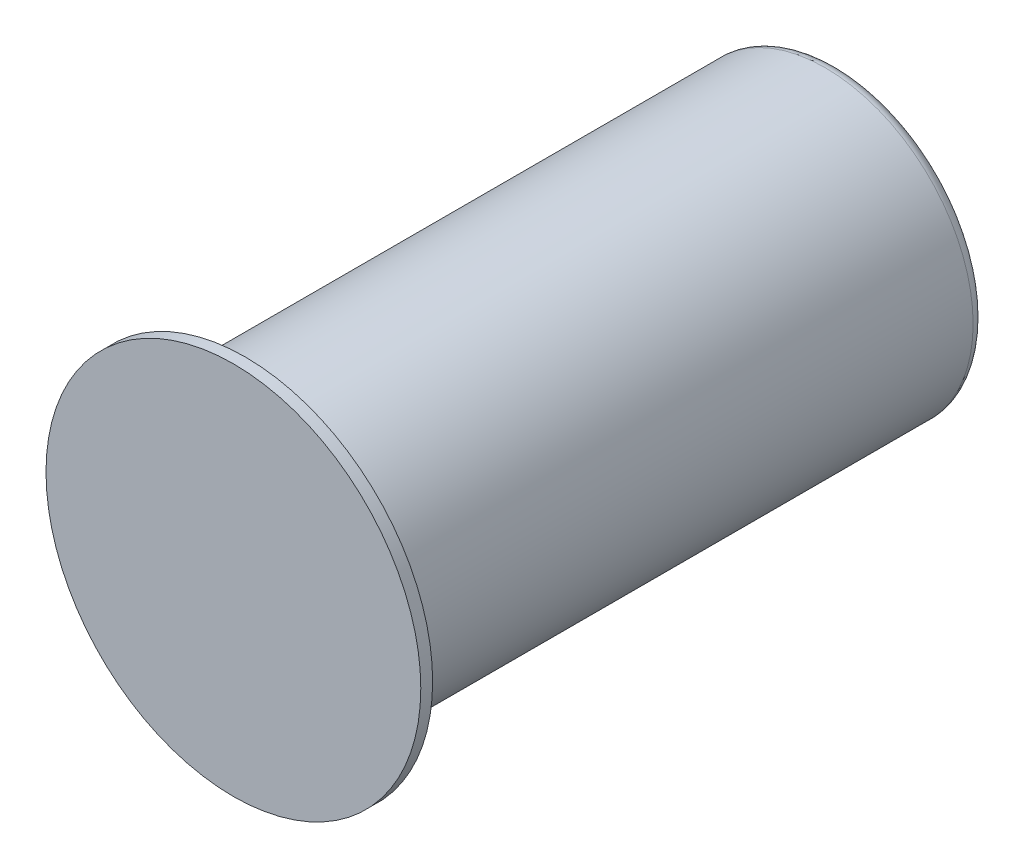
ISO-10303-21;
HEADER;
FILE_DESCRIPTION(('STEP AP214'),'2;1');
FILE_NAME('part.step','',(''),(''),'','','');
FILE_SCHEMA(('AUTOMOTIVE_DESIGN { 1 0 10303 214 1 1 1 1 }'));
ENDSEC;
DATA;
#1=APPLICATION_CONTEXT('core data for automotive mechanical design processes');
#2=APPLICATION_PROTOCOL_DEFINITION('international standard','automotive_design',2000,#1);
#3=PRODUCT_CONTEXT('',#1,'mechanical');
#4=PRODUCT('Part','Part','',(#3));
#5=PRODUCT_RELATED_PRODUCT_CATEGORY('part','',(#4));
#6=PRODUCT_DEFINITION_FORMATION('','',#4);
#7=PRODUCT_DEFINITION_CONTEXT('part definition',#1,'design');
#8=PRODUCT_DEFINITION('design','',#6,#7);
#9=PRODUCT_DEFINITION_SHAPE('','',#8);
#10=(LENGTH_UNIT() NAMED_UNIT(*) SI_UNIT(.MILLI.,.METRE.));
#11=(NAMED_UNIT(*) PLANE_ANGLE_UNIT() SI_UNIT($,.RADIAN.));
#12=(NAMED_UNIT(*) SI_UNIT($,.STERADIAN.) SOLID_ANGLE_UNIT());
#13=UNCERTAINTY_MEASURE_WITH_UNIT(LENGTH_MEASURE(1.E-05),#10,'distance_accuracy_value','');
#14=(GEOMETRIC_REPRESENTATION_CONTEXT(3) GLOBAL_UNCERTAINTY_ASSIGNED_CONTEXT((#13)) GLOBAL_UNIT_ASSIGNED_CONTEXT((#10,
#11,#12)) REPRESENTATION_CONTEXT('',''));
#15=CARTESIAN_POINT('',(0.,0.,0.));
#16=DIRECTION('',(0.,0.,1.));
#17=DIRECTION('',(1.,0.,0.));
#18=AXIS2_PLACEMENT_3D('',#15,#16,#17);
#19=CARTESIAN_POINT('',(0.,0.,0.));
#20=DIRECTION('',(0.,0.,-1.));
#21=DIRECTION('',(-1.,0.,0.));
#22=AXIS2_PLACEMENT_3D('',#19,#20,#21);
#23=PLANE('',#22);
#24=CARTESIAN_POINT('',(0.,0.,0.));
#25=DIRECTION('',(0.,0.,1.));
#26=DIRECTION('',(1.,0.,0.));
#27=AXIS2_PLACEMENT_3D('',#24,#25,#26);
#28=CIRCLE('',#27,47.5);
#29=CARTESIAN_POINT('',(47.5,0.,0.));
#30=VERTEX_POINT('',#29);
#31=EDGE_CURVE('E11',#30,#30,#28,.T.);
#32=ORIENTED_EDGE('',*,*,#31,.T.);
#33=EDGE_LOOP('',(#32));
#34=FACE_BOUND('',#33,.T.);
#35=ADVANCED_FACE('F36',(#34),#23,.F.);
#36=CARTESIAN_POINT('',(0.,0.,0.));
#37=DIRECTION('',(0.,0.,1.));
#38=DIRECTION('',(1.,0.,0.));
#39=AXIS2_PLACEMENT_3D('',#36,#37,#38);
#40=CYLINDRICAL_SURFACE('',#39,47.5);
#41=ORIENTED_EDGE('',*,*,#31,.F.);
#42=EDGE_LOOP('',(#41));
#43=FACE_BOUND('',#42,.T.);
#44=CARTESIAN_POINT('',(0.,0.,-3.));
#45=DIRECTION('',(0.,0.,1.));
#46=DIRECTION('',(1.,0.,0.));
#47=AXIS2_PLACEMENT_3D('',#44,#45,#46);
#48=CIRCLE('',#47,47.5);
#49=CARTESIAN_POINT('',(47.5,0.,-3.));
#50=VERTEX_POINT('',#49);
#51=EDGE_CURVE('E43',#50,#50,#48,.T.);
#52=ORIENTED_EDGE('',*,*,#51,.T.);
#53=EDGE_LOOP('',(#52));
#54=FACE_BOUND('',#53,.T.);
#55=ADVANCED_FACE('F58',(#43,#54),#40,.T.);
#56=CARTESIAN_POINT('',(0.,47.5,-3.));
#57=DIRECTION('',(0.,0.,1.));
#58=DIRECTION('',(1.,0.,0.));
#59=AXIS2_PLACEMENT_3D('',#56,#57,#58);
#60=PLANE('',#59);
#61=ORIENTED_EDGE('',*,*,#51,.F.);
#62=EDGE_LOOP('',(#61));
#63=FACE_BOUND('',#62,.T.);
#64=CARTESIAN_POINT('',(0.,0.,-3.));
#65=DIRECTION('',(0.,0.,1.));
#66=DIRECTION('',(1.,0.,0.));
#67=AXIS2_PLACEMENT_3D('',#64,#65,#66);
#68=CIRCLE('',#67,37.5);
#69=CARTESIAN_POINT('',(37.5,0.,-3.));
#70=VERTEX_POINT('',#69);
#71=EDGE_CURVE('E70',#70,#70,#68,.T.);
#72=ORIENTED_EDGE('',*,*,#71,.T.);
#73=EDGE_LOOP('',(#72));
#74=FACE_BOUND('',#73,.T.);
#75=ADVANCED_FACE('F62',(#63,#74),#60,.F.);
#76=CARTESIAN_POINT('',(0.,0.,0.));
#77=DIRECTION('',(0.,0.,1.));
#78=DIRECTION('',(1.,0.,0.));
#79=AXIS2_PLACEMENT_3D('',#76,#77,#78);
#80=CYLINDRICAL_SURFACE('',#79,37.5);
#81=ORIENTED_EDGE('',*,*,#71,.F.);
#82=EDGE_LOOP('',(#81));
#83=FACE_BOUND('',#82,.T.);
#84=CARTESIAN_POINT('',(0.,0.,-150.));
#85=DIRECTION('',(0.,0.,1.));
#86=DIRECTION('',(1.,0.,0.));
#87=AXIS2_PLACEMENT_3D('',#84,#85,#86);
#88=CIRCLE('',#87,37.4999999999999);
#89=CARTESIAN_POINT('',(37.4999999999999,0.,-150.));
#90=VERTEX_POINT('',#89);
#91=EDGE_CURVE('E73',#90,#90,#88,.T.);
#92=ORIENTED_EDGE('',*,*,#91,.T.);
#93=EDGE_LOOP('',(#92));
#94=FACE_BOUND('',#93,.T.);
#95=ADVANCED_FACE('F110',(#83,#94),#80,.T.);
#96=CARTESIAN_POINT('',(0.,0.,-150.));
#97=DIRECTION('',(0.,0.,1.));
#98=DIRECTION('',(1.,0.,0.));
#99=AXIS2_PLACEMENT_3D('',#96,#97,#98);
#100=TOROIDAL_SURFACE('',#99,34.5,3.);
#101=ORIENTED_EDGE('',*,*,#91,.F.);
#102=EDGE_LOOP('',(#101));
#103=FACE_BOUND('',#102,.T.);
#104=CARTESIAN_POINT('',(0.,0.,-153.));
#105=DIRECTION('',(0.,0.,1.));
#106=DIRECTION('',(1.,0.,0.));
#107=AXIS2_PLACEMENT_3D('',#104,#105,#106);
#108=CIRCLE('',#107,34.5);
#109=CARTESIAN_POINT('',(34.5,0.,-153.));
#110=VERTEX_POINT('',#109);
#111=EDGE_CURVE('E79',#110,#110,#108,.T.);
#112=ORIENTED_EDGE('',*,*,#111,.T.);
#113=EDGE_LOOP('',(#112));
#114=FACE_BOUND('',#113,.T.);
#115=ADVANCED_FACE('F103',(#103,#114),#100,.T.);
#116=CARTESIAN_POINT('',(0.,34.5,-153.));
#117=DIRECTION('',(0.,0.,1.));
#118=DIRECTION('',(1.,0.,0.));
#119=AXIS2_PLACEMENT_3D('',#116,#117,#118);
#120=PLANE('',#119);
#121=ORIENTED_EDGE('',*,*,#111,.F.);
#122=EDGE_LOOP('',(#121));
#123=FACE_BOUND('',#122,.T.);
#124=CARTESIAN_POINT('',(0.,0.,-153.));
#125=DIRECTION('',(0.,0.,1.));
#126=DIRECTION('',(1.,0.,0.));
#127=AXIS2_PLACEMENT_3D('',#124,#125,#126);
#128=CIRCLE('',#127,5.99999999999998);
#129=CARTESIAN_POINT('',(5.99999999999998,0.,-153.));
#130=VERTEX_POINT('',#129);
#131=EDGE_CURVE('E83',#130,#130,#128,.T.);
#132=ORIENTED_EDGE('',*,*,#131,.T.);
#133=EDGE_LOOP('',(#132));
#134=FACE_BOUND('',#133,.T.);
#135=ADVANCED_FACE('F98',(#123,#134),#120,.F.);
#136=CARTESIAN_POINT('',(0.,0.,-152.));
#137=DIRECTION('',(0.,0.,-1.));
#138=DIRECTION('',(-1.,0.,0.));
#139=AXIS2_PLACEMENT_3D('',#136,#137,#138);
#140=CONICAL_SURFACE('',#139,5.,0.785398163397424);
#141=ORIENTED_EDGE('',*,*,#131,.F.);
#142=EDGE_LOOP('',(#141));
#143=FACE_BOUND('',#142,.T.);
#144=CARTESIAN_POINT('',(0.,0.,-152.));
#145=DIRECTION('',(0.,0.,1.));
#146=DIRECTION('',(1.,0.,0.));
#147=AXIS2_PLACEMENT_3D('',#144,#145,#146);
#148=CIRCLE('',#147,5.);
#149=CARTESIAN_POINT('',(5.,0.,-152.));
#150=VERTEX_POINT('',#149);
#151=EDGE_CURVE('E87',#150,#150,#148,.T.);
#152=ORIENTED_EDGE('',*,*,#151,.T.);
#153=EDGE_LOOP('',(#152));
#154=FACE_BOUND('',#153,.T.);
#155=ADVANCED_FACE('F53',(#143,#154),#140,.F.);
#156=CARTESIAN_POINT('',(0.,0.,0.));
#157=DIRECTION('',(0.,0.,1.));
#158=DIRECTION('',(1.,0.,0.));
#159=AXIS2_PLACEMENT_3D('',#156,#157,#158);
#160=CYLINDRICAL_SURFACE('',#159,5.);
#161=ORIENTED_EDGE('',*,*,#151,.F.);
#162=EDGE_LOOP('',(#161));
#163=FACE_BOUND('',#162,.T.);
#164=CARTESIAN_POINT('',(0.,0.,-141.));
#165=DIRECTION('',(0.,0.,1.));
#166=DIRECTION('',(1.,0.,0.));
#167=AXIS2_PLACEMENT_3D('',#164,#165,#166);
#168=CIRCLE('',#167,5.);
#169=CARTESIAN_POINT('',(5.,0.,-141.));
#170=VERTEX_POINT('',#169);
#171=EDGE_CURVE('E91',#170,#170,#168,.T.);
#172=ORIENTED_EDGE('',*,*,#171,.T.);
#173=EDGE_LOOP('',(#172));
#174=FACE_BOUND('',#173,.T.);
#175=ADVANCED_FACE('F48',(#163,#174),#160,.F.);
#176=CARTESIAN_POINT('',(0.,0.,-138.113248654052));
#177=DIRECTION('',(0.,0.,-1.));
#178=DIRECTION('',(-1.,0.,0.));
#179=AXIS2_PLACEMENT_3D('',#176,#177,#178);
#180=CONICAL_SURFACE('',#179,0.,1.04719755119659);
#181=ORIENTED_EDGE('',*,*,#171,.F.);
#182=EDGE_LOOP('',(#181));
#183=FACE_BOUND('',#182,.T.);
#184=CARTESIAN_POINT('',(0.,0.,-138.113248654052));
#185=VERTEX_POINT('',#184);
#186=VERTEX_LOOP('',#185);
#187=FACE_BOUND('',#186,.T.);
#188=ADVANCED_FACE('F46',(#183,#187),#180,.F.);
#189=CLOSED_SHELL('',(#35,#55,#75,#95,#115,#135,#155,#175,#188));
#190=MANIFOLD_SOLID_BREP('B2',#189);
#191=ADVANCED_BREP_SHAPE_REPRESENTATION('',(#18,#190),#14);
#192=SHAPE_DEFINITION_REPRESENTATION(#9,#191);
ENDSEC;
END-ISO-10303-21;
